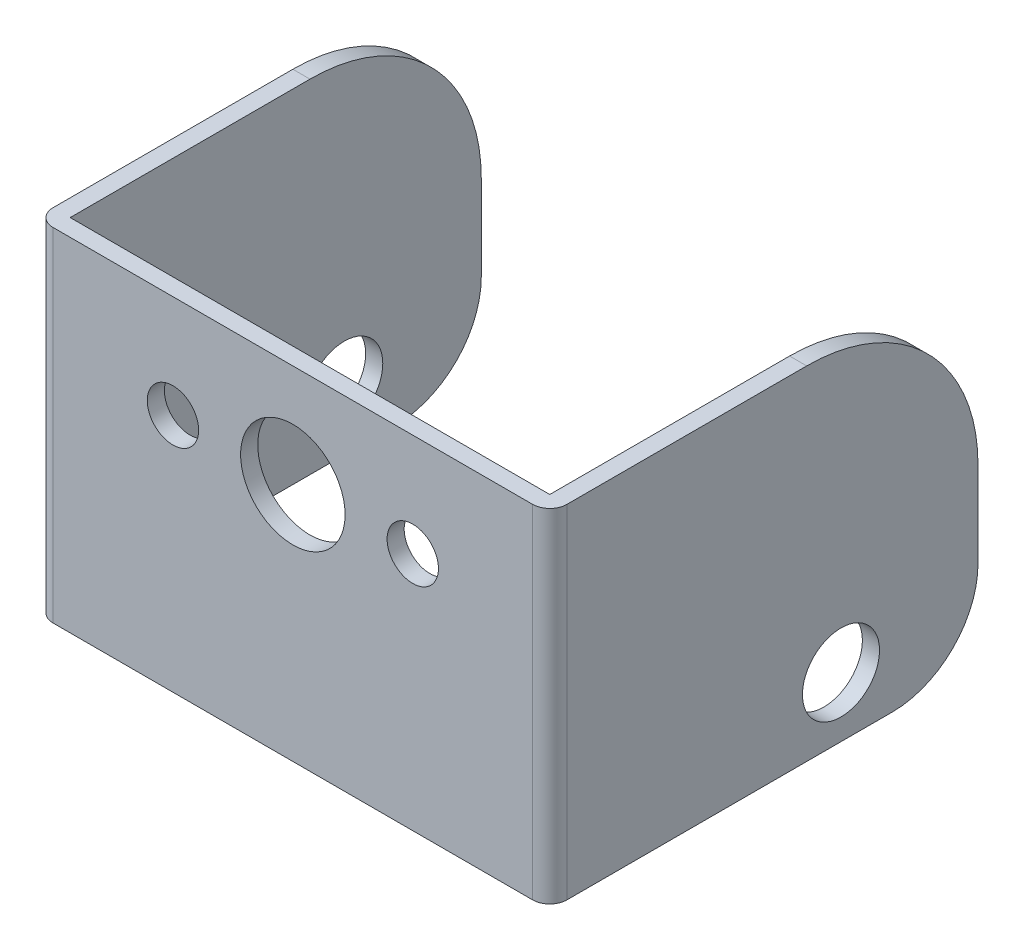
from build123d import *

# Parameters (mm, degrees)
EXTRUDE1_DEPTH = 20
SKETCH2_R      = 3.05
SKETCH2_R_2    = 1.5
EXTRUDE2_DEPTH = 25
SKETCH3_R      = 2.25
EXTRUDE3_DEPTH = 44.874821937
FILLET1_R      = 1
FILLET2_R      = 10
FILLET3_R      = 5


with BuildPart() as part:
    # Sketch1 → Extrude1 (new body)
    with BuildSketch(Plane(origin=(0, 0, 0), x_dir=(1, 0, 0), z_dir=(0, 1, 0))):
        Polygon((0, 0), (30, 0), (30, 25), (29, 25), (29, 1), (1, 1), (1, 25), (0, 25), align=None)
    extrude(amount=EXTRUDE1_DEPTH)

    # Sketch2 → Extrude2 (cut)
    with BuildSketch(Plane.XY):
        with Locations((15, 14)):
            Circle(SKETCH2_R)
        with Locations((22, 14)):
            Circle(SKETCH2_R_2)
        with Locations((8, 14)):
            Circle(SKETCH2_R_2)
    extrude(amount=-EXTRUDE2_DEPTH, mode=Mode.SUBTRACT)

    # Sketch3 → Extrude3 (cut, through all)
    with BuildSketch(Plane(origin=(30, 0, 0), x_dir=(0, 0, -1), z_dir=(1, 0, 0))):
        with Locations((17, 3.5)):
            Circle(SKETCH3_R)
    extrude(amount=-EXTRUDE3_DEPTH, mode=Mode.SUBTRACT)

    # Fillet1
    fillet1_edges = [part.edges().sort_by_distance(p)[0] for p in [
        (30, 10, 0),
        (0, 10, 0),
    ]]
    fillet(fillet1_edges, radius=FILLET1_R)

    # Fillet2
    fillet2_edges = [part.edges().sort_by_distance(p)[0] for p in [
        (29.5, 20, -25),
        (0.5, 20, -25),
    ]]
    fillet(fillet2_edges, radius=FILLET2_R)

    # Fillet3
    fillet3_edges = [part.edges().sort_by_distance(p)[0] for p in [
        (0.5, 0, -25),
        (29.5, 0, -25),
    ]]
    fillet(fillet3_edges, radius=FILLET3_R)


solid = part.part
